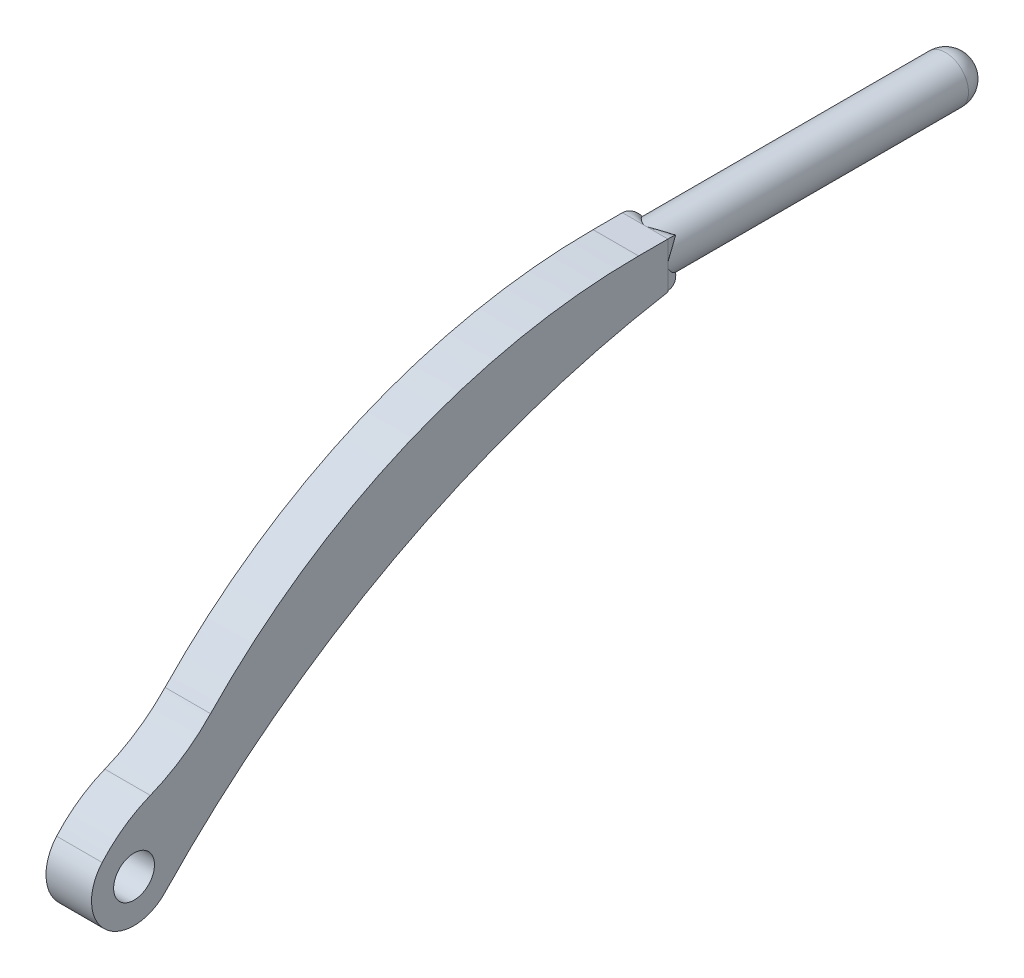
ISO-10303-21;
HEADER;
FILE_DESCRIPTION(('STEP AP214'),'2;1');
FILE_NAME('part.step','',(''),(''),'','','');
FILE_SCHEMA(('AUTOMOTIVE_DESIGN { 1 0 10303 214 1 1 1 1 }'));
ENDSEC;
DATA;
#1=APPLICATION_CONTEXT('core data for automotive mechanical design processes');
#2=APPLICATION_PROTOCOL_DEFINITION('international standard','automotive_design',2000,#1);
#3=PRODUCT_CONTEXT('',#1,'mechanical');
#4=PRODUCT('Part','Part','',(#3));
#5=PRODUCT_RELATED_PRODUCT_CATEGORY('part','',(#4));
#6=PRODUCT_DEFINITION_FORMATION('','',#4);
#7=PRODUCT_DEFINITION_CONTEXT('part definition',#1,'design');
#8=PRODUCT_DEFINITION('design','',#6,#7);
#9=PRODUCT_DEFINITION_SHAPE('','',#8);
#10=(LENGTH_UNIT() NAMED_UNIT(*) SI_UNIT(.MILLI.,.METRE.));
#11=(NAMED_UNIT(*) PLANE_ANGLE_UNIT() SI_UNIT($,.RADIAN.));
#12=(NAMED_UNIT(*) SI_UNIT($,.STERADIAN.) SOLID_ANGLE_UNIT());
#13=UNCERTAINTY_MEASURE_WITH_UNIT(LENGTH_MEASURE(1.E-05),#10,'distance_accuracy_value','');
#14=(GEOMETRIC_REPRESENTATION_CONTEXT(3) GLOBAL_UNCERTAINTY_ASSIGNED_CONTEXT((#13)) GLOBAL_UNIT_ASSIGNED_CONTEXT((#10,
#11,#12)) REPRESENTATION_CONTEXT('',''));
#15=CARTESIAN_POINT('',(0.,0.,0.));
#16=DIRECTION('',(0.,0.,1.));
#17=DIRECTION('',(1.,0.,0.));
#18=AXIS2_PLACEMENT_3D('',#15,#16,#17);
#19=CARTESIAN_POINT('',(0.,15.658076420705,-27.9975293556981));
#20=DIRECTION('',(0.,0.,-1.));
#21=DIRECTION('',(-1.,0.,0.));
#22=AXIS2_PLACEMENT_3D('',#19,#20,#21);
#23=CYLINDRICAL_SURFACE('',#22,1.3716);
#24=CARTESIAN_POINT('',(0.,15.658076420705,-49.8094));
#25=DIRECTION('',(0.,0.,1.));
#26=DIRECTION('',(1.,0.,0.));
#27=AXIS2_PLACEMENT_3D('',#24,#25,#26);
#28=CIRCLE('',#27,1.3716);
#29=CARTESIAN_POINT('',(1.3716,15.658076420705,-49.8094));
#30=VERTEX_POINT('',#29);
#31=EDGE_CURVE('E252',#30,#30,#28,.T.);
#32=ORIENTED_EDGE('',*,*,#31,.T.);
#33=EDGE_LOOP('',(#32));
#34=FACE_BOUND('',#33,.T.);
#35=CARTESIAN_POINT('',(-1.12012259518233,14.8664881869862,-32.8386269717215));
#36=CARTESIAN_POINT('',(-1.10384434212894,14.8434571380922,-32.8098896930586));
#37=CARTESIAN_POINT('',(-1.08693265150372,14.8210302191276,-32.7810355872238));
#38=CARTESIAN_POINT('',(-1.05188217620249,14.7773865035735,-32.7231599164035));
#39=CARTESIAN_POINT('',(-1.03374344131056,14.7561696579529,-32.6941383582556));
#40=CARTESIAN_POINT('',(-0.977538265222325,14.6943276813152,-32.6069089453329));
#41=CARTESIAN_POINT('',(-0.937688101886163,14.655518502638,-32.5485456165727));
#42=CARTESIAN_POINT('',(-0.853977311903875,14.583356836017,-32.4325555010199));
#43=CARTESIAN_POINT('',(-0.810166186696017,14.5499484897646,-32.3749277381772));
#44=CARTESIAN_POINT('',(-0.741596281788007,14.5039187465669,-32.2886403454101));
#45=CARTESIAN_POINT('',(-0.718270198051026,14.4892590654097,-32.2599106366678));
#46=CARTESIAN_POINT('',(-0.670839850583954,14.4614087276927,-32.2023838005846));
#47=CARTESIAN_POINT('',(-0.646735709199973,14.4482178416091,-32.1735866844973));
#48=CARTESIAN_POINT('',(-0.609870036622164,14.4294402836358,-32.1294331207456));
#49=CARTESIAN_POINT('',(-0.597209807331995,14.4232394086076,-32.114250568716));
#50=CARTESIAN_POINT('',(-0.571969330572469,14.4113481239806,-32.0835917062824));
#51=CARTESIAN_POINT('',(-0.559389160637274,14.4056581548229,-32.0681151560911));
#52=CARTESIAN_POINT('',(-0.53646080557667,14.3956859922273,-32.0388807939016));
#53=CARTESIAN_POINT('',(-0.526053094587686,14.3913192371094,-32.0251984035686));
#54=CARTESIAN_POINT('',(-0.506024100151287,14.3831878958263,-31.9970703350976));
#55=CARTESIAN_POINT('',(-0.49640223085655,14.3794228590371,-31.9826252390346));
#56=CARTESIAN_POINT('',(-0.483193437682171,14.3743959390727,-31.959421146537));
#57=CARTESIAN_POINT('',(-0.478887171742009,14.3727863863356,-31.9511585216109));
#58=CARTESIAN_POINT('',(-0.471236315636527,14.369961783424,-31.9341285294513));
#59=CARTESIAN_POINT('',(-0.467890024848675,14.3687460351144,-31.9253620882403));
#60=CARTESIAN_POINT('',(-0.463253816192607,14.3670739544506,-31.9092502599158));
#61=CARTESIAN_POINT('',(-0.461677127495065,14.3665108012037,-31.9020020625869));
#62=CARTESIAN_POINT('',(-0.459721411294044,14.3658132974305,-31.8873372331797));
#63=CARTESIAN_POINT('',(-0.459338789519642,14.3656776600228,-31.8799211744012));
#64=CARTESIAN_POINT('',(-0.459841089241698,14.3658563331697,-31.8651469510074));
#65=CARTESIAN_POINT('',(-0.460724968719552,14.366170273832,-31.8577887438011));
#66=CARTESIAN_POINT('',(-0.463592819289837,14.3671966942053,-31.8432837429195));
#67=CARTESIAN_POINT('',(-0.465583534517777,14.3679116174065,-31.8361385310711));
#68=CARTESIAN_POINT('',(-0.470378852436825,14.3696523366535,-31.822176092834));
#69=CARTESIAN_POINT('',(-0.473183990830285,14.3706783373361,-31.8153590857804));
#70=CARTESIAN_POINT('',(-0.479328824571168,14.3729532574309,-31.8021184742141));
#71=CARTESIAN_POINT('',(-0.482660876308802,14.3741990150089,-31.7956908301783));
#72=CARTESIAN_POINT('',(-0.486159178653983,14.3755259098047,-31.7893975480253));
#73=B_SPLINE_CURVE_WITH_KNOTS('',3,(#35,#36,#37,#38,#39,#40,#41,#42,#43,#44,#45,#46,#47,#48,#49,
#50,#51,#52,#53,#54,#55,#56,#57,#58,#59,#60,#61,#62,#63,#64,#65,#66,#67,#68,#69,#70,#71,#72),
.UNSPECIFIED.,.F.,.F.,(4,2,2,2,2,2,2,2,2,2,2,2,2,2,2,2,2,2,4),(0.,0.120772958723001,
0.241541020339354,0.483115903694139,0.722005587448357,0.841391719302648,0.960759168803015,
1.02290967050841,1.08511324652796,1.13831430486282,1.19147533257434,1.21980019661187,
1.24807456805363,1.27030031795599,1.29245910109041,1.3145996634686,1.33687663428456,
1.35916829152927,1.38116208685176),.UNSPECIFIED.);
#74=CARTESIAN_POINT('',(-1.01927650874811,14.740273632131,-32.6717009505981));
#75=VERTEX_POINT('',#74);
#76=CARTESIAN_POINT('',(-0.459513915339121,14.3657399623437,-31.877));
#77=VERTEX_POINT('',#76);
#78=EDGE_CURVE('E48',#75,#77,#73,.T.);
#79=ORIENTED_EDGE('',*,*,#78,.F.);
#80=CARTESIAN_POINT('',(-1.34017268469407,15.3661453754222,-31.7893975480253));
#81=CARTESIAN_POINT('',(-1.34136294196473,15.3716093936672,-31.7934983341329));
#82=CARTESIAN_POINT('',(-1.34252400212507,15.3771003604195,-31.7975708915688));
#83=CARTESIAN_POINT('',(-1.34478797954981,15.3881436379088,-31.8056799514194));
#84=CARTESIAN_POINT('',(-1.345890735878,15.3936960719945,-31.8097163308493));
#85=CARTESIAN_POINT('',(-1.34812954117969,15.4053482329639,-31.8181177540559));
#86=CARTESIAN_POINT('',(-1.34925948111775,15.4114517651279,-31.8224792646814));
#87=CARTESIAN_POINT('',(-1.35143266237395,15.4236520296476,-31.8311889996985));
#88=CARTESIAN_POINT('',(-1.35247614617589,15.4297487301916,-31.8355372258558));
#89=CARTESIAN_POINT('',(-1.35447564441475,15.441928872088,-31.8443449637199));
#90=CARTESIAN_POINT('',(-1.35543131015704,15.4480121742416,-31.8488048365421));
#91=CARTESIAN_POINT('',(-1.35673946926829,15.4566985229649,-31.8558241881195));
#92=CARTESIAN_POINT('',(-1.35714821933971,15.4594738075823,-31.858173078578));
#93=CARTESIAN_POINT('',(-1.35790854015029,15.4647440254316,-31.8631704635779));
#94=CARTESIAN_POINT('',(-1.35826089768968,15.4672426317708,-31.8658137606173));
#95=CARTESIAN_POINT('',(-1.35856182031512,15.4694062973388,-31.8692331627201));
#96=CARTESIAN_POINT('',(-1.35859391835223,15.4696376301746,-31.8696191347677));
#97=CARTESIAN_POINT('',(-1.35865452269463,15.4700751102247,-31.8704054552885));
#98=CARTESIAN_POINT('',(-1.35868302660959,15.470281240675,-31.870805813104));
#99=CARTESIAN_POINT('',(-1.35876190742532,15.470852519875,-31.8720249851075));
#100=CARTESIAN_POINT('',(-1.35880607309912,15.4711735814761,-31.8728664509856));
#101=CARTESIAN_POINT('',(-1.35886319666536,15.4715894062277,-31.8743924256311));
#102=CARTESIAN_POINT('',(-1.35888106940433,15.47171976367,-31.8750668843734));
#103=CARTESIAN_POINT('',(-1.35890078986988,15.4718636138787,-31.876429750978));
#104=CARTESIAN_POINT('',(-1.35890262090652,15.4718769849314,-31.8771181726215));
#105=CARTESIAN_POINT('',(-1.35888993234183,15.471784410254,-31.8784853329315));
#106=CARTESIAN_POINT('',(-1.35887543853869,15.471678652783,-31.8791640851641));
#107=CARTESIAN_POINT('',(-1.35883215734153,15.4713633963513,-31.8804957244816));
#108=CARTESIAN_POINT('',(-1.35880336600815,15.4711538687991,-31.8811486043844));
#109=CARTESIAN_POINT('',(-1.35871142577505,15.4704864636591,-31.8828486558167));
#110=CARTESIAN_POINT('',(-1.3586381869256,15.4699562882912,-31.8838663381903));
#111=CARTESIAN_POINT('',(-1.35847163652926,15.4687572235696,-31.8858161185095));
#112=CARTESIAN_POINT('',(-1.35837822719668,15.468087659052,-31.8867477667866));
#113=CARTESIAN_POINT('',(-1.35792031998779,15.4648269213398,-31.8909037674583));
#114=CARTESIAN_POINT('',(-1.35748578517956,15.4617901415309,-31.8937514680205));
#115=CARTESIAN_POINT('',(-1.3565630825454,15.4555080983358,-31.8991887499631));
#116=CARTESIAN_POINT('',(-1.35607453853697,15.4522614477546,-31.9017762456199));
#117=CARTESIAN_POINT('',(-1.35456902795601,15.4425038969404,-31.9092929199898));
#118=CARTESIAN_POINT('',(-1.35349808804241,15.4358736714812,-31.9140658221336));
#119=CARTESIAN_POINT('',(-1.35125244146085,15.4225993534,-31.9235667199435));
#120=CARTESIAN_POINT('',(-1.35007764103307,15.4159552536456,-31.9282946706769));
#121=CARTESIAN_POINT('',(-1.3464266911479,15.3961596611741,-31.9424726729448));
#122=CARTESIAN_POINT('',(-1.34381181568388,15.3830659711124,-31.9519719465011));
#123=CARTESIAN_POINT('',(-1.33543584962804,15.3440536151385,-31.9810715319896));
#124=CARTESIAN_POINT('',(-1.32917315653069,15.3185936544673,-32.0011469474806));
#125=CARTESIAN_POINT('',(-1.31549020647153,15.2689290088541,-32.0424340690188));
#126=CARTESIAN_POINT('',(-1.30806942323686,15.2447249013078,-32.0636462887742));
#127=CARTESIAN_POINT('',(-1.28414556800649,15.173535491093,-32.1289242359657));
#128=CARTESIAN_POINT('',(-1.26606135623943,15.1283290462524,-32.1743589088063));
#129=CARTESIAN_POINT('',(-1.22534907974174,15.0397705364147,-32.2699313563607));
#130=CARTESIAN_POINT('',(-1.20253216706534,14.9966407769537,-32.3201908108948));
#131=CARTESIAN_POINT('',(-1.15346925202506,14.9143773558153,-32.4223638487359));
#132=CARTESIAN_POINT('',(-1.12721960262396,14.8752480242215,-32.4742791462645));
#133=CARTESIAN_POINT('',(-1.07218512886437,14.8014641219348,-32.5780510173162));
#134=CARTESIAN_POINT('',(-1.04346167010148,14.7667355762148,-32.6298879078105));
#135=CARTESIAN_POINT('',(-0.983283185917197,14.7007821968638,-32.7339994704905));
#136=CARTESIAN_POINT('',(-0.951834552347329,14.6695495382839,-32.7862728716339));
#137=CARTESIAN_POINT('',(-0.919076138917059,14.6399479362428,-32.8386269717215));
#138=B_SPLINE_CURVE_WITH_KNOTS('',3,(#80,#81,#82,#83,#84,#85,#86,#87,#88,#89,#90,#91,#92,#93,
#94,#95,#96,#97,#98,#99,#100,#101,#102,#103,#104,#105,#106,#107,#108,#109,#110,#111,#112,#113,
#114,#115,#116,#117,#118,#119,#120,#121,#122,#123,#124,#125,#126,#127,#128,#129,#130,#131,#132,
#133,#134,#135,#136,#137),.UNSPECIFIED.,.F.,.F.,(4,2,2,2,2,2,2,2,2,2,2,2,2,2,2,2,2,2,2,2,2,2,2,
2,2,2,2,2,4),(0.,0.020802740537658,0.0416601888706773,0.0644165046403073,0.087106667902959,
0.109883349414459,0.120875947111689,0.131698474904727,0.133050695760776,0.134403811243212,
0.137093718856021,0.13914629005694,0.141200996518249,0.143252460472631,0.145304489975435,
0.148733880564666,0.152180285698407,0.164640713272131,0.177194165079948,0.201892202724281,
0.226612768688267,0.275762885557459,0.374752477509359,0.473787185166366,0.673214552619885,
0.88312243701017,1.09325517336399,1.29917574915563,1.5046257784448),.UNSPECIFIED.);
#139=CARTESIAN_POINT('',(-1.3589,15.4718578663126,-31.877));
#140=VERTEX_POINT('',#139);
#141=EDGE_CURVE('E160',#140,#75,#138,.T.);
#142=ORIENTED_EDGE('',*,*,#141,.F.);
#143=CARTESIAN_POINT('',(0.,15.658076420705,-31.877));
#144=DIRECTION('',(0.,0.,1.));
#145=DIRECTION('',(1.,0.,0.));
#146=AXIS2_PLACEMENT_3D('',#143,#144,#145);
#147=CIRCLE('',#146,1.3716);
#148=CARTESIAN_POINT('',(-1.3589,15.8442949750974,-31.877));
#149=VERTEX_POINT('',#148);
#150=EDGE_CURVE('E155',#149,#140,#147,.T.);
#151=ORIENTED_EDGE('',*,*,#150,.F.);
#152=CARTESIAN_POINT('',(-1.3589,15.8442949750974,-31.877));
#153=CARTESIAN_POINT('',(-1.35889585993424,15.8443251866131,-31.8770168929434));
#154=CARTESIAN_POINT('',(-1.35889170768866,15.8443554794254,-31.8770336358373));
#155=CARTESIAN_POINT('',(-1.35888556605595,15.8444002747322,-31.8770583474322));
#156=CARTESIAN_POINT('',(-1.35888357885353,15.8444147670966,-31.8770663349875));
#157=CARTESIAN_POINT('',(-1.35887364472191,15.8444872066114,-31.8771063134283));
#158=CARTESIAN_POINT('',(-1.35886570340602,15.8445450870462,-31.8771384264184));
#159=CARTESIAN_POINT('',(-1.35882597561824,15.8448345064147,-31.8772989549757));
#160=CARTESIAN_POINT('',(-1.35879412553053,15.845066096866,-31.8774272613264));
#161=CARTESIAN_POINT('',(-1.35863462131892,15.8462237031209,-31.8780693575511));
#162=CARTESIAN_POINT('',(-1.35850620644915,15.8471486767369,-31.8785848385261));
#163=CARTESIAN_POINT('',(-1.35785994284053,15.8517691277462,-31.8811693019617));
#164=CARTESIAN_POINT('',(-1.35732956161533,15.8554510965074,-31.8832593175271));
#165=CARTESIAN_POINT('',(-1.35461172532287,15.8737931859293,-31.8938217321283));
#166=CARTESIAN_POINT('',(-1.35222843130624,15.888235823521,-31.9026232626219));
#167=CARTESIAN_POINT('',(-1.34448386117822,15.9310093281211,-31.9299468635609));
#168=CARTESIAN_POINT('',(-1.33854016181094,15.9586832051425,-31.9493339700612));
#169=CARTESIAN_POINT('',(-1.32531024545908,16.012486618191,-31.9897426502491));
#170=CARTESIAN_POINT('',(-1.31802273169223,16.0386146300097,-32.0107657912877));
#171=CARTESIAN_POINT('',(-1.29697744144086,16.1065389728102,-32.0685143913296));
#172=CARTESIAN_POINT('',(-1.28215774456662,16.1470937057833,-32.1063163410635));
#173=CARTESIAN_POINT('',(-1.24971172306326,16.2248920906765,-32.1840814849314));
#174=CARTESIAN_POINT('',(-1.23208230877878,16.2621320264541,-32.2240470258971));
#175=CARTESIAN_POINT('',(-1.17527619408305,16.3698741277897,-32.346578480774));
#176=CARTESIAN_POINT('',(-1.13233934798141,16.4359264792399,-32.4313508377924));
#177=CARTESIAN_POINT('',(-1.04845165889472,16.5444356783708,-32.5845330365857));
#178=CARTESIAN_POINT('',(-1.00912184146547,16.5888930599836,-32.6524646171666));
#179=CARTESIAN_POINT('',(-0.925669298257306,16.6719267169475,-32.7890619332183));
#180=CARTESIAN_POINT('',(-0.881543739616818,16.7104994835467,-32.8577280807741));
#181=CARTESIAN_POINT('',(-0.78958220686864,16.7810810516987,-32.9936618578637));
#182=CARTESIAN_POINT('',(-0.74183494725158,16.8132027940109,-33.0609307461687));
#183=CARTESIAN_POINT('',(-0.666920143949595,16.8569669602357,-33.1612261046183));
#184=CARTESIAN_POINT('',(-0.641409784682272,16.8708142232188,-33.1945441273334));
#185=CARTESIAN_POINT('',(-0.589262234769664,16.8969896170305,-33.260900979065));
#186=CARTESIAN_POINT('',(-0.562624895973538,16.9093175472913,-33.2939397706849));
#187=CARTESIAN_POINT('',(-0.535415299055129,16.9208578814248,-33.3267919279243));
#188=B_SPLINE_CURVE_WITH_KNOTS('',3,(#152,#153,#154,#155,#156,#157,#158,#159,#160,#161,#162,
#163,#164,#165,#166,#167,#168,#169,#170,#171,#172,#173,#174,#175,#176,#177,#178,#179,#180,#181,
#182,#183,#184,#185,#186,#187),.UNSPECIFIED.,.F.,.F.,(4,2,2,2,2,2,2,2,2,2,2,2,2,2,2,2,2,4),(0.,
0.000104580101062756,0.000154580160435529,0.000354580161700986,0.00115458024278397,
0.00435458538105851,0.0171549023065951,0.0683725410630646,0.171155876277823,0.274038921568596,
0.445909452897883,0.617970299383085,0.964042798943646,1.23439404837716,1.50490587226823,
1.77016351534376,1.90269254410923,2.03523904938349),.UNSPECIFIED.);
#189=CARTESIAN_POINT('',(-0.983239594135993,16.6143851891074,-32.6946557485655));
#190=VERTEX_POINT('',#189);
#191=EDGE_CURVE('E213',#190,#149,#188,.F.);
#192=ORIENTED_EDGE('',*,*,#191,.F.);
#193=CARTESIAN_POINT('',(-0.0527930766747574,17.0286600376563,-31.877));
#194=CARTESIAN_POINT('',(-0.0528976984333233,17.0286560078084,-31.8770283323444));
#195=CARTESIAN_POINT('',(-0.0530025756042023,17.0286519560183,-31.8770556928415));
#196=CARTESIAN_POINT('',(-0.0531284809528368,17.0286470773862,-31.8770887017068));
#197=CARTESIAN_POINT('',(-0.0531495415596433,17.0286462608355,-31.8770942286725));
#198=CARTESIAN_POINT('',(-0.0532548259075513,17.0286421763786,-31.8771219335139));
#199=CARTESIAN_POINT('',(-0.0533389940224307,17.0286389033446,-31.8771443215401));
#200=CARTESIAN_POINT('',(-0.0537598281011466,17.0286224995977,-31.8772562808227));
#201=CARTESIAN_POINT('',(-0.0540964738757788,17.0286092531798,-31.8773459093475));
#202=CARTESIAN_POINT('',(-0.0557791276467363,17.0285424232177,-31.8777961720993));
#203=CARTESIAN_POINT('',(-0.0571233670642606,17.0284870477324,-31.8781631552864));
#204=CARTESIAN_POINT('',(-0.0638367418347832,17.0282006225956,-31.8800280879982));
#205=CARTESIAN_POINT('',(-0.0691799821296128,17.0279410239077,-31.8816154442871));
#206=CARTESIAN_POINT('',(-0.0957924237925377,17.0264934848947,-31.8899732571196));
#207=CARTESIAN_POINT('',(-0.116649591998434,17.0248608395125,-31.8979796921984));
#208=CARTESIAN_POINT('',(-0.178336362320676,17.0186662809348,-31.9246234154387));
#209=CARTESIAN_POINT('',(-0.217908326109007,17.0128138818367,-31.9457920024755));
#210=CARTESIAN_POINT('',(-0.294372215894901,16.9982814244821,-31.9918228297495));
#211=CARTESIAN_POINT('',(-0.331252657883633,16.9895900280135,-32.0166996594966));
#212=CARTESIAN_POINT('',(-0.410718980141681,16.9675277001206,-32.0747392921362));
#213=CARTESIAN_POINT('',(-0.452695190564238,16.9535420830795,-32.1084999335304));
#214=CARTESIAN_POINT('',(-0.533518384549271,16.9224015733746,-32.1782545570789));
#215=CARTESIAN_POINT('',(-0.572361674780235,16.9052430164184,-32.2142510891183));
#216=CARTESIAN_POINT('',(-0.684917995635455,16.8493899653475,-32.3246557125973));
#217=CARTESIAN_POINT('',(-0.754391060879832,16.8063978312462,-32.4012696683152));
#218=CARTESIAN_POINT('',(-0.862632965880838,16.72584324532,-32.5318720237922));
#219=CARTESIAN_POINT('',(-0.904137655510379,16.6909060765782,-32.5853026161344));
#220=CARTESIAN_POINT('',(-0.98255298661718,16.6166143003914,-32.6925296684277));
#221=CARTESIAN_POINT('',(-1.01946203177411,16.5772581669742,-32.7463262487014));
#222=CARTESIAN_POINT('',(-1.08810928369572,16.4948245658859,-32.8528401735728));
#223=CARTESIAN_POINT('',(-1.11991345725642,16.45180785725,-32.9055619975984));
#224=CARTESIAN_POINT('',(-1.17868184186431,16.3615443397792,-33.0100290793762));
#225=CARTESIAN_POINT('',(-1.20564772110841,16.3142989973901,-33.0617746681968));
#226=CARTESIAN_POINT('',(-1.23005968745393,16.2649040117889,-33.112716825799));
#227=B_SPLINE_CURVE_WITH_KNOTS('',3,(#193,#194,#195,#196,#197,#198,#199,#200,#201,#202,#203,
#204,#205,#206,#207,#208,#209,#210,#211,#212,#213,#214,#215,#216,#217,#218,#219,#220,#221,#222,
#223,#224,#225,#226),.UNSPECIFIED.,.F.,.F.,(4,2,2,2,2,2,2,2,2,2,2,2,2,2,2,2,4),(0.,
0.000325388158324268,0.000390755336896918,0.000652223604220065,0.00169809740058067,
0.00588163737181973,0.0226183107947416,0.0896693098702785,0.224903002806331,0.360683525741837,
0.527340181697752,0.694190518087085,1.02892357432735,1.25714455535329,1.48544459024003,
1.71050369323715,1.93548504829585),.UNSPECIFIED.);
#228=CARTESIAN_POINT('',(-0.0527930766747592,17.0286600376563,-31.877));
#229=VERTEX_POINT('',#228);
#230=EDGE_CURVE('E219',#229,#190,#227,.T.);
#231=ORIENTED_EDGE('',*,*,#230,.F.);
#232=CARTESIAN_POINT('',(0.0527930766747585,17.0286600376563,-31.877));
#233=DIRECTION('',(-1.,0.,0.));
#234=VECTOR('',#233,1.);
#235=LINE('',#232,#234);
#236=CARTESIAN_POINT('',(0.0527930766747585,17.0286600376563,-31.877));
#237=VERTEX_POINT('',#236);
#238=EDGE_CURVE('E339',#237,#229,#235,.T.);
#239=ORIENTED_EDGE('',*,*,#238,.F.);
#240=CARTESIAN_POINT('',(0.0527930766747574,17.0286600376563,-31.877));
#241=CARTESIAN_POINT('',(0.0528976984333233,17.0286560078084,-31.8770283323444));
#242=CARTESIAN_POINT('',(0.0530025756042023,17.0286519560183,-31.8770556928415));
#243=CARTESIAN_POINT('',(0.0531284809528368,17.0286470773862,-31.8770887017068));
#244=CARTESIAN_POINT('',(0.0531495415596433,17.0286462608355,-31.8770942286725));
#245=CARTESIAN_POINT('',(0.0532548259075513,17.0286421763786,-31.8771219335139));
#246=CARTESIAN_POINT('',(0.0533389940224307,17.0286389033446,-31.8771443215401));
#247=CARTESIAN_POINT('',(0.0537598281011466,17.0286224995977,-31.8772562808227));
#248=CARTESIAN_POINT('',(0.0540964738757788,17.0286092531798,-31.8773459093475));
#249=CARTESIAN_POINT('',(0.0557791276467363,17.0285424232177,-31.8777961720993));
#250=CARTESIAN_POINT('',(0.0571233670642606,17.0284870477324,-31.8781631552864));
#251=CARTESIAN_POINT('',(0.0638367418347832,17.0282006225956,-31.8800280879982));
#252=CARTESIAN_POINT('',(0.0691799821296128,17.0279410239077,-31.8816154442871));
#253=CARTESIAN_POINT('',(0.0957924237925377,17.0264934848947,-31.8899732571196));
#254=CARTESIAN_POINT('',(0.116649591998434,17.0248608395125,-31.8979796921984));
#255=CARTESIAN_POINT('',(0.178336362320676,17.0186662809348,-31.9246234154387));
#256=CARTESIAN_POINT('',(0.217908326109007,17.0128138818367,-31.9457920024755));
#257=CARTESIAN_POINT('',(0.294372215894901,16.9982814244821,-31.9918228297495));
#258=CARTESIAN_POINT('',(0.331252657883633,16.9895900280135,-32.0166996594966));
#259=CARTESIAN_POINT('',(0.410718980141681,16.9675277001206,-32.0747392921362));
#260=CARTESIAN_POINT('',(0.452695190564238,16.9535420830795,-32.1084999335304));
#261=CARTESIAN_POINT('',(0.533518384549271,16.9224015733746,-32.1782545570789));
#262=CARTESIAN_POINT('',(0.572361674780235,16.9052430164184,-32.2142510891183));
#263=CARTESIAN_POINT('',(0.684917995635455,16.8493899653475,-32.3246557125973));
#264=CARTESIAN_POINT('',(0.754391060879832,16.8063978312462,-32.4012696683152));
#265=CARTESIAN_POINT('',(0.862632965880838,16.72584324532,-32.5318720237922));
#266=CARTESIAN_POINT('',(0.904137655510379,16.6909060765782,-32.5853026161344));
#267=CARTESIAN_POINT('',(0.98255298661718,16.6166143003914,-32.6925296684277));
#268=CARTESIAN_POINT('',(1.01946203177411,16.5772581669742,-32.7463262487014));
#269=CARTESIAN_POINT('',(1.08810928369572,16.4948245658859,-32.8528401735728));
#270=CARTESIAN_POINT('',(1.11991345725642,16.45180785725,-32.9055619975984));
#271=CARTESIAN_POINT('',(1.17868184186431,16.3615443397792,-33.0100290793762));
#272=CARTESIAN_POINT('',(1.20564772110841,16.3142989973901,-33.0617746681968));
#273=CARTESIAN_POINT('',(1.23005968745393,16.2649040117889,-33.112716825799));
#274=B_SPLINE_CURVE_WITH_KNOTS('',3,(#240,#241,#242,#243,#244,#245,#246,#247,#248,#249,#250,
#251,#252,#253,#254,#255,#256,#257,#258,#259,#260,#261,#262,#263,#264,#265,#266,#267,#268,#269,
#270,#271,#272,#273),.UNSPECIFIED.,.F.,.F.,(4,2,2,2,2,2,2,2,2,2,2,2,2,2,2,2,4),(0.,
0.000325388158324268,0.000390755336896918,0.000652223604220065,0.00169809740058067,
0.00588163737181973,0.0226183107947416,0.0896693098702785,0.224903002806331,0.360683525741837,
0.527340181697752,0.694190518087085,1.02892357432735,1.25714455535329,1.48544459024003,
1.71050369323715,1.93548504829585),.UNSPECIFIED.);
#275=CARTESIAN_POINT('',(0.983239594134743,16.614385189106,-32.6946557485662));
#276=VERTEX_POINT('',#275);
#277=EDGE_CURVE('E41',#276,#237,#274,.F.);
#278=ORIENTED_EDGE('',*,*,#277,.F.);
#279=CARTESIAN_POINT('',(1.3589,15.8442949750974,-31.877));
#280=CARTESIAN_POINT('',(1.35889585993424,15.8443251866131,-31.8770168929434));
#281=CARTESIAN_POINT('',(1.35889170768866,15.8443554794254,-31.8770336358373));
#282=CARTESIAN_POINT('',(1.35888556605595,15.8444002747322,-31.8770583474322));
#283=CARTESIAN_POINT('',(1.35888357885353,15.8444147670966,-31.8770663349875));
#284=CARTESIAN_POINT('',(1.35887364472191,15.8444872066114,-31.8771063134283));
#285=CARTESIAN_POINT('',(1.35886570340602,15.8445450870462,-31.8771384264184));
#286=CARTESIAN_POINT('',(1.35882597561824,15.8448345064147,-31.8772989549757));
#287=CARTESIAN_POINT('',(1.35879412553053,15.845066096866,-31.8774272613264));
#288=CARTESIAN_POINT('',(1.35863462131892,15.8462237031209,-31.8780693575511));
#289=CARTESIAN_POINT('',(1.35850620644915,15.8471486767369,-31.8785848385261));
#290=CARTESIAN_POINT('',(1.35785994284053,15.8517691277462,-31.8811693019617));
#291=CARTESIAN_POINT('',(1.35732956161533,15.8554510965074,-31.8832593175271));
#292=CARTESIAN_POINT('',(1.35461172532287,15.8737931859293,-31.8938217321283));
#293=CARTESIAN_POINT('',(1.35222843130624,15.888235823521,-31.9026232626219));
#294=CARTESIAN_POINT('',(1.34448386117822,15.9310093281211,-31.9299468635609));
#295=CARTESIAN_POINT('',(1.33854016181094,15.9586832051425,-31.9493339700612));
#296=CARTESIAN_POINT('',(1.32531024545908,16.012486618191,-31.9897426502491));
#297=CARTESIAN_POINT('',(1.31802273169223,16.0386146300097,-32.0107657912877));
#298=CARTESIAN_POINT('',(1.29697744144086,16.1065389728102,-32.0685143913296));
#299=CARTESIAN_POINT('',(1.28215774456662,16.1470937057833,-32.1063163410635));
#300=CARTESIAN_POINT('',(1.24971172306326,16.2248920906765,-32.1840814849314));
#301=CARTESIAN_POINT('',(1.23208230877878,16.2621320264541,-32.2240470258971));
#302=CARTESIAN_POINT('',(1.17527619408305,16.3698741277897,-32.346578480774));
#303=CARTESIAN_POINT('',(1.13233934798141,16.4359264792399,-32.4313508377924));
#304=CARTESIAN_POINT('',(1.04845165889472,16.5444356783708,-32.5845330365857));
#305=CARTESIAN_POINT('',(1.00912184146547,16.5888930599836,-32.6524646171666));
#306=CARTESIAN_POINT('',(0.925669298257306,16.6719267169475,-32.7890619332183));
#307=CARTESIAN_POINT('',(0.881543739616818,16.7104994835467,-32.8577280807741));
#308=CARTESIAN_POINT('',(0.78958220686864,16.7810810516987,-32.9936618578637));
#309=CARTESIAN_POINT('',(0.74183494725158,16.8132027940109,-33.0609307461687));
#310=CARTESIAN_POINT('',(0.666920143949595,16.8569669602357,-33.1612261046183));
#311=CARTESIAN_POINT('',(0.641409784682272,16.8708142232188,-33.1945441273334));
#312=CARTESIAN_POINT('',(0.589262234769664,16.8969896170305,-33.260900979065));
#313=CARTESIAN_POINT('',(0.562624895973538,16.9093175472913,-33.2939397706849));
#314=CARTESIAN_POINT('',(0.535415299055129,16.9208578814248,-33.3267919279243));
#315=B_SPLINE_CURVE_WITH_KNOTS('',3,(#279,#280,#281,#282,#283,#284,#285,#286,#287,#288,#289,
#290,#291,#292,#293,#294,#295,#296,#297,#298,#299,#300,#301,#302,#303,#304,#305,#306,#307,#308,
#309,#310,#311,#312,#313,#314),.UNSPECIFIED.,.F.,.F.,(4,2,2,2,2,2,2,2,2,2,2,2,2,2,2,2,2,4),(0.,
0.000104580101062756,0.000154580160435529,0.000354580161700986,0.00115458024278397,
0.00435458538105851,0.0171549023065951,0.0683725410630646,0.171155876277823,0.274038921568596,
0.445909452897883,0.617970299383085,0.964042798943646,1.23439404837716,1.50490587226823,
1.77016351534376,1.90269254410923,2.03523904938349),.UNSPECIFIED.);
#316=CARTESIAN_POINT('',(1.3589,15.8442949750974,-31.877));
#317=VERTEX_POINT('',#316);
#318=EDGE_CURVE('E357',#317,#276,#315,.T.);
#319=ORIENTED_EDGE('',*,*,#318,.F.);
#320=CARTESIAN_POINT('',(1.3589,15.4718578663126,-31.877));
#321=VERTEX_POINT('',#320);
#322=EDGE_CURVE('E159',#321,#317,#147,.T.);
#323=ORIENTED_EDGE('',*,*,#322,.F.);
#324=CARTESIAN_POINT('',(0.919076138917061,14.6399479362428,-32.8386269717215));
#325=CARTESIAN_POINT('',(0.940274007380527,14.6590873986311,-32.804752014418));
#326=CARTESIAN_POINT('',(0.960913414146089,14.6789161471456,-32.7709245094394));
#327=CARTESIAN_POINT('',(1.0010527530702,14.7199899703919,-32.7034376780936));
#328=CARTESIAN_POINT('',(1.02055235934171,14.7412354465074,-32.669778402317));
#329=CARTESIAN_POINT('',(1.07742634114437,14.8072950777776,-32.5689500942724));
#330=CARTESIAN_POINT('',(1.11302257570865,14.854294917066,-32.5021760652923));
#331=CARTESIAN_POINT('',(1.17681942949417,14.9513001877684,-32.3750207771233));
#332=CARTESIAN_POINT('',(1.20534983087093,15.0009134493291,-32.3145056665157));
#333=CARTESIAN_POINT('',(1.25710585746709,15.1063315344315,-32.1966691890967));
#334=CARTESIAN_POINT('',(1.28033861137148,15.1621278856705,-32.1393436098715));
#335=CARTESIAN_POINT('',(1.30647568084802,15.2400073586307,-32.067984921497));
#336=CARTESIAN_POINT('',(1.3123418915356,15.2587746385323,-32.0513837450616));
#337=CARTESIAN_POINT('',(1.3206214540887,15.2874759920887,-32.0269858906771));
#338=CARTESIAN_POINT('',(1.32329273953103,15.2971268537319,-32.0189435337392));
#339=CARTESIAN_POINT('',(1.32845632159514,15.3166207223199,-32.0030325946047));
#340=CARTESIAN_POINT('',(1.3309485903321,15.3264637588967,-31.9951640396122));
#341=CARTESIAN_POINT('',(1.33574501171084,15.3463451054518,-31.9796094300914));
#342=CARTESIAN_POINT('',(1.33804908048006,15.3563835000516,-31.9719234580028));
#343=CARTESIAN_POINT('',(1.34245529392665,15.3766376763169,-31.9567335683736));
#344=CARTESIAN_POINT('',(1.34455748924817,15.3868534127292,-31.9492296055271));
#345=CARTESIAN_POINT('',(1.34854494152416,15.4074320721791,-31.934371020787));
#346=CARTESIAN_POINT('',(1.35043017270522,15.4177950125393,-31.9270164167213));
#347=CARTESIAN_POINT('',(1.35306944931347,15.4333162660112,-31.9158923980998));
#348=CARTESIAN_POINT('',(1.35391775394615,15.4384859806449,-31.9121691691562));
#349=CARTESIAN_POINT('',(1.35553727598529,15.4487150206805,-31.9045651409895));
#350=CARTESIAN_POINT('',(1.35630837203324,15.4537741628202,-31.9006841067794));
#351=CARTESIAN_POINT('',(1.3575163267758,15.4619979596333,-31.8935756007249));
#352=CARTESIAN_POINT('',(1.35798316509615,15.4652677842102,-31.8905127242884));
#353=CARTESIAN_POINT('',(1.35842803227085,15.4684447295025,-31.8862410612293));
#354=CARTESIAN_POINT('',(1.35849777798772,15.4689453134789,-31.8855157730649));
#355=CARTESIAN_POINT('',(1.35862523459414,15.4698631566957,-31.8840114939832));
#356=CARTESIAN_POINT('',(1.35868293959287,15.470280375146,-31.8832324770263));
#357=CARTESIAN_POINT('',(1.3587741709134,15.4709416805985,-31.8817346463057));
#358=CARTESIAN_POINT('',(1.35880998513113,15.4712020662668,-31.8810233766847));
#359=CARTESIAN_POINT('',(1.358864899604,15.4716017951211,-31.8795675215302));
#360=CARTESIAN_POINT('',(1.35888404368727,15.4717414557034,-31.8788230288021));
#361=CARTESIAN_POINT('',(1.3589027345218,15.4718778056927,-31.8773139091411));
#362=CARTESIAN_POINT('',(1.35890211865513,15.4718733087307,-31.8765491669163));
#363=CARTESIAN_POINT('',(1.35888098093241,15.4717191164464,-31.8750346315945));
#364=CARTESIAN_POINT('',(1.35886043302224,15.47156923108,-31.8742848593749));
#365=CARTESIAN_POINT('',(1.3587954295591,15.471096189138,-31.8726352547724));
#366=CARTESIAN_POINT('',(1.3587462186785,15.4707386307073,-31.8717458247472));
#367=CARTESIAN_POINT('',(1.35862947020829,15.4698937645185,-31.870032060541));
#368=CARTESIAN_POINT('',(1.35856187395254,15.4694060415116,-31.8692079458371));
#369=CARTESIAN_POINT('',(1.35827277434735,15.4673305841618,-31.8660711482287));
#370=CARTESIAN_POINT('',(1.35800694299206,15.4654432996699,-31.8639698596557));
#371=CARTESIAN_POINT('',(1.35743508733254,15.4614527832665,-31.8599876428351));
#372=CARTESIAN_POINT('',(1.35712872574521,15.4593477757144,-31.8581088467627));
#373=CARTESIAN_POINT('',(1.35607057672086,15.452202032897,-31.8520445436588));
#374=CARTESIAN_POINT('',(1.35526609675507,15.4469644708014,-31.8480984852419));
#375=CARTESIAN_POINT('',(1.35358026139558,15.4364093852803,-31.8403316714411));
#376=CARTESIAN_POINT('',(1.35269877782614,15.4310917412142,-31.8365111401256));
#377=CARTESIAN_POINT('',(1.34996426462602,15.4151816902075,-31.825122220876));
#378=CARTESIAN_POINT('',(1.34801324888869,15.4045784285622,-31.8175874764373));
#379=CARTESIAN_POINT('',(1.34503208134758,15.3893791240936,-31.8065783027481));
#380=CARTESIAN_POINT('',(1.34409183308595,15.3847152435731,-31.8031713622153));
#381=CARTESIAN_POINT('',(1.34216573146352,15.3754101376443,-31.7963147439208));
#382=CARTESIAN_POINT('',(1.34117977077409,15.3707689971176,-31.7928649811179));
#383=CARTESIAN_POINT('',(1.34017268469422,15.3661453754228,-31.7893975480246));
#384=B_SPLINE_CURVE_WITH_KNOTS('',3,(#324,#325,#326,#327,#328,#329,#330,#331,#332,#333,#334,
#335,#336,#337,#338,#339,#340,#341,#342,#343,#344,#345,#346,#347,#348,#349,#350,#351,#352,#353,
#354,#355,#356,#357,#358,#359,#360,#361,#362,#363,#364,#365,#366,#367,#368,#369,#370,#371,#372,
#373,#374,#375,#376,#377,#378,#379,#380,#381,#382,#383),.UNSPECIFIED.,.F.,.F.,(4,2,2,2,2,2,2,2,
2,2,2,2,2,2,2,2,2,2,2,2,2,2,2,2,2,2,2,2,2,4),(0.,0.132901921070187,0.265841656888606,
0.532679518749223,0.782224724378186,1.03143212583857,1.10860972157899,1.14713649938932,
1.18566926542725,1.22421911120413,1.26275926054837,1.30130398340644,1.32057502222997,
1.33987589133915,1.35325747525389,1.35590517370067,1.35855416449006,1.36082073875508,
1.36308133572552,1.3653605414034,1.36764273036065,1.37050602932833,1.37337857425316,
1.38181978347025,1.3903362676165,1.41012873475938,1.4299547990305,1.46940616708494,
1.48696134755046,1.50456006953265),.UNSPECIFIED.);
#385=CARTESIAN_POINT('',(1.01927650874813,14.740273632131,-32.6717009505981));
#386=VERTEX_POINT('',#385);
#387=EDGE_CURVE('E206',#386,#321,#384,.T.);
#388=ORIENTED_EDGE('',*,*,#387,.F.);
#389=CARTESIAN_POINT('',(0.486159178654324,14.3755259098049,-31.7893975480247));
#390=CARTESIAN_POINT('',(0.481531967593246,14.3737696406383,-31.7977298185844));
#391=CARTESIAN_POINT('',(0.477169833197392,14.3721475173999,-31.8063394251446));
#392=CARTESIAN_POINT('',(0.469509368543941,14.3693316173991,-31.8242305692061));
#393=CARTESIAN_POINT('',(0.466228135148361,14.3681446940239,-31.8335203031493));
#394=CARTESIAN_POINT('',(0.462055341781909,14.3666449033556,-31.8501779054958));
#395=CARTESIAN_POINT('',(0.460766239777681,14.3661857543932,-31.8574256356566));
#396=CARTESIAN_POINT('',(0.4594101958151,14.3657028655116,-31.8720030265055));
#397=CARTESIAN_POINT('',(0.459334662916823,14.3656760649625,-31.8793317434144));
#398=CARTESIAN_POINT('',(0.460396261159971,14.3660539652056,-31.893884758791));
#399=CARTESIAN_POINT('',(0.461533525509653,14.3664587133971,-31.9011090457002));
#400=CARTESIAN_POINT('',(0.46482397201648,14.367639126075,-31.9153060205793));
#401=CARTESIAN_POINT('',(0.46698080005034,14.3684161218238,-31.9222777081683));
#402=CARTESIAN_POINT('',(0.475775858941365,14.3716216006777,-31.9460834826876));
#403=CARTESIAN_POINT('',(0.484294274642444,14.3747828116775,-31.9620858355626));
#404=CARTESIAN_POINT('',(0.50306033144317,14.3820190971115,-31.9928616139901));
#405=CARTESIAN_POINT('',(0.513324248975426,14.3861029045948,-32.0076213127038));
#406=CARTESIAN_POINT('',(0.535706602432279,14.3953542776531,-32.0380446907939));
#407=CARTESIAN_POINT('',(0.547904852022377,14.4005916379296,-32.0536292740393));
#408=CARTESIAN_POINT('',(0.572580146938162,14.4116323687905,-32.0843744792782));
#409=CARTESIAN_POINT('',(0.585057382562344,14.4174361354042,-32.0995347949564));
#410=CARTESIAN_POINT('',(0.622542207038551,14.4355805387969,-32.1447490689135));
#411=CARTESIAN_POINT('',(0.647572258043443,14.4486417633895,-32.1744982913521));
#412=CARTESIAN_POINT('',(0.696779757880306,14.4763055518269,-32.2337125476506));
#413=CARTESIAN_POINT('',(0.720960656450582,14.4909005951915,-32.2631782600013));
#414=CARTESIAN_POINT('',(0.768350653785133,14.5215382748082,-32.3221074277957));
#415=CARTESIAN_POINT('',(0.791560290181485,14.5375800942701,-32.35157087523));
#416=CARTESIAN_POINT('',(0.843477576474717,14.5758779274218,-32.4190960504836));
#417=CARTESIAN_POINT('',(0.8718294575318,14.5985876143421,-32.4571752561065));
#418=CARTESIAN_POINT('',(0.926634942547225,14.6461714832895,-32.5333644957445));
#419=CARTESIAN_POINT('',(0.953088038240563,14.6710462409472,-32.5714745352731));
#420=CARTESIAN_POINT('',(1.00422595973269,14.7231106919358,-32.6479233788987));
#421=CARTESIAN_POINT('',(1.02889378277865,14.7503183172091,-32.6862613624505));
#422=CARTESIAN_POINT('',(1.07611504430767,14.8068336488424,-32.7626768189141));
#423=CARTESIAN_POINT('',(1.09866885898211,14.8361409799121,-32.8007543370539));
#424=CARTESIAN_POINT('',(1.12012259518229,14.8664881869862,-32.8386269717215));
#425=B_SPLINE_CURVE_WITH_KNOTS('',3,(#389,#390,#391,#392,#393,#394,#395,#396,#397,#398,#399,
#400,#401,#402,#403,#404,#405,#406,#407,#408,#409,#410,#411,#412,#413,#414,#415,#416,#417,#418,
#419,#420,#421,#422,#423,#424),.UNSPECIFIED.,.F.,.F.,(4,2,2,2,2,2,2,2,2,2,2,2,2,2,2,2,2,4),(0.,
0.0292078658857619,0.0588577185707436,0.0808825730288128,0.102751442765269,0.124622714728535,
0.146572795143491,0.201326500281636,0.256621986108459,0.317998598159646,0.37941843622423,
0.502409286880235,0.62482299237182,0.747168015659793,0.904966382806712,1.06280683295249,
1.22199328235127,1.38115135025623),.UNSPECIFIED.);
#426=CARTESIAN_POINT('',(0.459513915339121,14.3657399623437,-31.877));
#427=VERTEX_POINT('',#426);
#428=EDGE_CURVE('E199',#427,#386,#425,.T.);
#429=ORIENTED_EDGE('',*,*,#428,.F.);
#430=CARTESIAN_POINT('',(0.0527930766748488,14.2874928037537,-31.877));
#431=VERTEX_POINT('',#430);
#432=EDGE_CURVE('E267',#431,#427,#147,.T.);
#433=ORIENTED_EDGE('',*,*,#432,.F.);
#434=CARTESIAN_POINT('',(0.,15.658076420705,-31.877));
#435=DIRECTION('',(0.,0.,-1.));
#436=DIRECTION('',(0.0384901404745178,-0.999258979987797,0.));
#437=AXIS2_PLACEMENT_3D('',#434,#435,#436);
#438=CIRCLE('',#437,1.3716);
#439=CARTESIAN_POINT('',(-0.0527930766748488,14.2874928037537,-31.877));
#440=VERTEX_POINT('',#439);
#441=EDGE_CURVE('E281',#431,#440,#438,.T.);
#442=ORIENTED_EDGE('',*,*,#441,.T.);
#443=EDGE_CURVE('E35',#77,#440,#147,.T.);
#444=ORIENTED_EDGE('',*,*,#443,.F.);
#445=EDGE_LOOP('',(#79,#142,#151,#192,#231,#239,#278,#319,#323,#388,#429,#433,#442,#444));
#446=FACE_BOUND('',#445,.T.);
#447=ADVANCED_FACE('F31',(#34,#446),#23,.T.);
#448=CARTESIAN_POINT('',(1.3589,17.0286600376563,-31.877));
#449=DIRECTION('',(0.,0.,1.));
#450=DIRECTION('',(1.,0.,0.));
#451=AXIS2_PLACEMENT_3D('',#448,#449,#450);
#452=PLANE('',#451);
#453=DIRECTION('',(-1.,0.,0.));
#454=VECTOR('',#453,1.);
#455=CARTESIAN_POINT('',(-0.0527930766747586,14.3657399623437,-31.877));
#456=LINE('',#455,#454);
#457=CARTESIAN_POINT('',(-1.3589,14.3657399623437,-31.877));
#458=VERTEX_POINT('',#457);
#459=EDGE_CURVE('E56',#77,#458,#456,.T.);
#460=ORIENTED_EDGE('',*,*,#459,.F.);
#461=ORIENTED_EDGE('',*,*,#443,.T.);
#462=DIRECTION('',(-1.,0.,0.));
#463=VECTOR('',#462,1.);
#464=CARTESIAN_POINT('',(1.3589,14.2874928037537,-31.877));
#465=LINE('',#464,#463);
#466=CARTESIAN_POINT('',(-1.3589,14.2874928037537,-31.877));
#467=VERTEX_POINT('',#466);
#468=EDGE_CURVE('E282',#440,#467,#465,.T.);
#469=ORIENTED_EDGE('',*,*,#468,.T.);
#470=DIRECTION('',(0.,1.,0.));
#471=VECTOR('',#470,1.);
#472=CARTESIAN_POINT('',(-1.3589,17.0286600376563,-31.877));
#473=LINE('',#472,#471);
#474=EDGE_CURVE('E152',#467,#458,#473,.T.);
#475=ORIENTED_EDGE('',*,*,#474,.T.);
#476=EDGE_LOOP('',(#460,#461,#469,#475));
#477=FACE_BOUND('',#476,.T.);
#478=ADVANCED_FACE('F380',(#477),#452,.F.);
#479=DIRECTION('',(1.,0.,0.));
#480=VECTOR('',#479,1.);
#481=CARTESIAN_POINT('',(0.0527930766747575,14.3657399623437,-31.877));
#482=LINE('',#481,#480);
#483=CARTESIAN_POINT('',(1.3589,14.3657399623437,-31.877));
#484=VERTEX_POINT('',#483);
#485=EDGE_CURVE('E11',#484,#427,#482,.F.);
#486=ORIENTED_EDGE('',*,*,#485,.F.);
#487=DIRECTION('',(0.,1.,0.));
#488=VECTOR('',#487,1.);
#489=CARTESIAN_POINT('',(1.3589,17.0286600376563,-31.877));
#490=LINE('',#489,#488);
#491=CARTESIAN_POINT('',(1.3589,14.2874928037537,-31.877));
#492=VERTEX_POINT('',#491);
#493=EDGE_CURVE('E305',#492,#484,#490,.T.);
#494=ORIENTED_EDGE('',*,*,#493,.F.);
#495=EDGE_CURVE('E276',#492,#431,#465,.T.);
#496=ORIENTED_EDGE('',*,*,#495,.T.);
#497=ORIENTED_EDGE('',*,*,#432,.T.);
#498=EDGE_LOOP('',(#486,#494,#496,#497));
#499=FACE_BOUND('',#498,.T.);
#500=ADVANCED_FACE('F303',(#499),#452,.F.);
#501=CARTESIAN_POINT('',(1.3589,-3.36010416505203,-3.81));
#502=DIRECTION('',(1.,0.,0.));
#503=DIRECTION('',(0.,0.,-1.));
#504=AXIS2_PLACEMENT_3D('',#501,#502,#503);
#505=PLANE('',#504);
#506=CARTESIAN_POINT('',(1.3589,-3.36010416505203,-3.81));
#507=DIRECTION('',(1.,0.,0.));
#508=DIRECTION('',(0.,0.,-1.));
#509=AXIS2_PLACEMENT_3D('',#506,#507,#508);
#510=CIRCLE('',#509,7.62);
#511=CARTESIAN_POINT('',(1.3589,3.71143615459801,-0.971388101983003));
#512=VERTEX_POINT('',#511);
#513=CARTESIAN_POINT('',(1.3589,1.68005208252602,1.905));
#514=VERTEX_POINT('',#513);
#515=EDGE_CURVE('E318',#512,#514,#510,.T.);
#516=ORIENTED_EDGE('',*,*,#515,.T.);
#517=CARTESIAN_POINT('',(1.3589,0.,0.));
#518=DIRECTION('',(1.,0.,0.));
#519=DIRECTION('',(0.,0.,-1.));
#520=AXIS2_PLACEMENT_3D('',#517,#518,#519);
#521=CIRCLE('',#520,2.54);
#522=CARTESIAN_POINT('',(1.3589,-1.75139474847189,-1.83962399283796));
#523=VERTEX_POINT('',#522);
#524=EDGE_CURVE('E317',#514,#523,#521,.T.);
#525=ORIENTED_EDGE('',*,*,#524,.T.);
#526=CARTESIAN_POINT('',(1.3589,-39.1261586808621,-41.0972));
#527=DIRECTION('',(-1.,0.,0.));
#528=DIRECTION('',(0.,0.,-1.));
#529=AXIS2_PLACEMENT_3D('',#526,#527,#528);
#530=CIRCLE('',#529,54.2036);
#531=EDGE_CURVE('E315',#523,#492,#530,.T.);
#532=ORIENTED_EDGE('',*,*,#531,.T.);
#533=ORIENTED_EDGE('',*,*,#493,.T.);
#534=DIRECTION('',(0.,1.,0.));
#535=VECTOR('',#534,1.);
#536=CARTESIAN_POINT('',(1.3589,14.3657399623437,-31.877));
#537=LINE('',#536,#535);
#538=EDGE_CURVE('E510',#484,#321,#537,.T.);
#539=ORIENTED_EDGE('',*,*,#538,.T.);
#540=EDGE_CURVE('E309',#321,#317,#490,.T.);
#541=ORIENTED_EDGE('',*,*,#540,.T.);
#542=CARTESIAN_POINT('',(1.3589,17.0286600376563,-31.877));
#543=VERTEX_POINT('',#542);
#544=EDGE_CURVE('E311',#317,#543,#490,.T.);
#545=ORIENTED_EDGE('',*,*,#544,.T.);
#546=DIRECTION('',(0.,0.,1.));
#547=VECTOR('',#546,1.);
#548=CARTESIAN_POINT('',(1.3589,17.0286600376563,-30.1244));
#549=LINE('',#548,#547);
#550=CARTESIAN_POINT('',(1.3589,17.0286600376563,-30.1244));
#551=VERTEX_POINT('',#550);
#552=EDGE_CURVE('E308',#543,#551,#549,.T.);
#553=ORIENTED_EDGE('',*,*,#552,.T.);
#554=CARTESIAN_POINT('',(1.3589,-18.4043399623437,-30.1244));
#555=DIRECTION('',(1.,0.,0.));
#556=DIRECTION('',(0.,0.,-1.));
#557=AXIS2_PLACEMENT_3D('',#554,#555,#556);
#558=CIRCLE('',#557,35.433);
#559=CARTESIAN_POINT('',(1.3589,6.13861875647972,-4.56778312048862));
#560=VERTEX_POINT('',#559);
#561=EDGE_CURVE('E312',#551,#560,#558,.T.);
#562=ORIENTED_EDGE('',*,*,#561,.T.);
#563=CARTESIAN_POINT('',(1.3589,13.2815873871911,2.8702));
#564=DIRECTION('',(-1.,0.,0.));
#565=DIRECTION('',(0.,0.,-1.));
#566=AXIS2_PLACEMENT_3D('',#563,#564,#565);
#567=CIRCLE('',#566,10.3124);
#568=EDGE_CURVE('E438',#560,#512,#567,.T.);
#569=ORIENTED_EDGE('',*,*,#568,.T.);
#570=EDGE_LOOP('',(#516,#525,#532,#533,#539,#541,#545,#553,#562,#569));
#571=FACE_BOUND('',#570,.T.);
#572=CARTESIAN_POINT('',(1.3589,0.,0.));
#573=DIRECTION('',(1.,0.,0.));
#574=DIRECTION('',(0.,0.,-1.));
#575=AXIS2_PLACEMENT_3D('',#572,#573,#574);
#576=CIRCLE('',#575,1.2192);
#577=CARTESIAN_POINT('',(1.3589,0.,-1.2192));
#578=VERTEX_POINT('',#577);
#579=EDGE_CURVE('E326',#578,#578,#576,.T.);
#580=ORIENTED_EDGE('',*,*,#579,.F.);
#581=EDGE_LOOP('',(#580));
#582=FACE_BOUND('',#581,.T.);
#583=ADVANCED_FACE('F379',(#571,#582),#505,.T.);
#584=CARTESIAN_POINT('',(-1.3589,-3.36010416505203,-3.81));
#585=DIRECTION('',(1.,0.,0.));
#586=DIRECTION('',(0.,0.,-1.));
#587=AXIS2_PLACEMENT_3D('',#584,#585,#586);
#588=PLANE('',#587);
#589=CARTESIAN_POINT('',(-1.3589,-3.36010416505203,-3.81));
#590=DIRECTION('',(1.,0.,0.));
#591=DIRECTION('',(0.,0.,-1.));
#592=AXIS2_PLACEMENT_3D('',#589,#590,#591);
#593=CIRCLE('',#592,7.62);
#594=CARTESIAN_POINT('',(-1.3589,3.71143615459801,-0.971388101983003));
#595=VERTEX_POINT('',#594);
#596=CARTESIAN_POINT('',(-1.3589,1.68005208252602,1.905));
#597=VERTEX_POINT('',#596);
#598=EDGE_CURVE('E329',#595,#597,#593,.T.);
#599=ORIENTED_EDGE('',*,*,#598,.F.);
#600=CARTESIAN_POINT('',(-1.3589,13.2815873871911,2.8702));
#601=DIRECTION('',(-1.,0.,0.));
#602=DIRECTION('',(0.,0.,-1.));
#603=AXIS2_PLACEMENT_3D('',#600,#601,#602);
#604=CIRCLE('',#603,10.3124);
#605=CARTESIAN_POINT('',(-1.3589,6.13861875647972,-4.56778312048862));
#606=VERTEX_POINT('',#605);
#607=EDGE_CURVE('E323',#606,#595,#604,.T.);
#608=ORIENTED_EDGE('',*,*,#607,.F.);
#609=CARTESIAN_POINT('',(-1.3589,-18.4043399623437,-30.1244));
#610=DIRECTION('',(1.,0.,0.));
#611=DIRECTION('',(0.,0.,-1.));
#612=AXIS2_PLACEMENT_3D('',#609,#610,#611);
#613=CIRCLE('',#612,35.433);
#614=CARTESIAN_POINT('',(-1.3589,17.0286600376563,-30.1244));
#615=VERTEX_POINT('',#614);
#616=EDGE_CURVE('E434',#615,#606,#613,.T.);
#617=ORIENTED_EDGE('',*,*,#616,.F.);
#618=DIRECTION('',(0.,0.,1.));
#619=VECTOR('',#618,1.);
#620=CARTESIAN_POINT('',(-1.3589,17.0286600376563,-30.1244));
#621=LINE('',#620,#619);
#622=CARTESIAN_POINT('',(-1.3589,17.0286600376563,-31.877));
#623=VERTEX_POINT('',#622);
#624=EDGE_CURVE('E449',#623,#615,#621,.T.);
#625=ORIENTED_EDGE('',*,*,#624,.F.);
#626=EDGE_CURVE('E149',#149,#623,#473,.T.);
#627=ORIENTED_EDGE('',*,*,#626,.F.);
#628=EDGE_CURVE('E140',#140,#149,#473,.T.);
#629=ORIENTED_EDGE('',*,*,#628,.F.);
#630=DIRECTION('',(0.,1.,0.));
#631=VECTOR('',#630,1.);
#632=CARTESIAN_POINT('',(-1.3589,14.3657399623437,-31.877));
#633=LINE('',#632,#631);
#634=EDGE_CURVE('E147',#458,#140,#633,.T.);
#635=ORIENTED_EDGE('',*,*,#634,.F.);
#636=ORIENTED_EDGE('',*,*,#474,.F.);
#637=CARTESIAN_POINT('',(-1.3589,-39.1261586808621,-41.0972));
#638=DIRECTION('',(-1.,0.,0.));
#639=DIRECTION('',(0.,0.,-1.));
#640=AXIS2_PLACEMENT_3D('',#637,#638,#639);
#641=CIRCLE('',#640,54.2036);
#642=CARTESIAN_POINT('',(-1.3589,-1.75139474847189,-1.83962399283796));
#643=VERTEX_POINT('',#642);
#644=EDGE_CURVE('E443',#643,#467,#641,.T.);
#645=ORIENTED_EDGE('',*,*,#644,.F.);
#646=CARTESIAN_POINT('',(-1.3589,0.,0.));
#647=DIRECTION('',(1.,0.,0.));
#648=DIRECTION('',(0.,0.,-1.));
#649=AXIS2_PLACEMENT_3D('',#646,#647,#648);
#650=CIRCLE('',#649,2.54);
#651=EDGE_CURVE('E441',#597,#643,#650,.T.);
#652=ORIENTED_EDGE('',*,*,#651,.F.);
#653=EDGE_LOOP('',(#599,#608,#617,#625,#627,#629,#635,#636,#645,#652));
#654=FACE_BOUND('',#653,.T.);
#655=CARTESIAN_POINT('',(-1.3589,0.,0.));
#656=DIRECTION('',(1.,0.,0.));
#657=DIRECTION('',(0.,0.,-1.));
#658=AXIS2_PLACEMENT_3D('',#655,#656,#657);
#659=CIRCLE('',#658,1.2192);
#660=CARTESIAN_POINT('',(-1.3589,0.,-1.2192));
#661=VERTEX_POINT('',#660);
#662=EDGE_CURVE('E158',#661,#661,#659,.T.);
#663=ORIENTED_EDGE('',*,*,#662,.T.);
#664=EDGE_LOOP('',(#663));
#665=FACE_BOUND('',#664,.T.);
#666=ADVANCED_FACE('F143',(#654,#665),#588,.F.);
#667=CARTESIAN_POINT('',(1.3589,-3.36010416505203,-3.81));
#668=DIRECTION('',(-1.,0.,0.));
#669=DIRECTION('',(0.,0.,1.));
#670=AXIS2_PLACEMENT_3D('',#667,#668,#669);
#671=CYLINDRICAL_SURFACE('',#670,7.62);
#672=ORIENTED_EDGE('',*,*,#598,.T.);
#673=DIRECTION('',(-1.,0.,0.));
#674=VECTOR('',#673,1.);
#675=CARTESIAN_POINT('',(1.3589,1.68005208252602,1.905));
#676=LINE('',#675,#674);
#677=EDGE_CURVE('E271',#514,#597,#676,.T.);
#678=ORIENTED_EDGE('',*,*,#677,.F.);
#679=ORIENTED_EDGE('',*,*,#515,.F.);
#680=DIRECTION('',(-1.,0.,0.));
#681=VECTOR('',#680,1.);
#682=CARTESIAN_POINT('',(1.3589,3.71143615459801,-0.971388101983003));
#683=LINE('',#682,#681);
#684=EDGE_CURVE('E429',#512,#595,#683,.T.);
#685=ORIENTED_EDGE('',*,*,#684,.T.);
#686=EDGE_LOOP('',(#672,#678,#679,#685));
#687=FACE_BOUND('',#686,.T.);
#688=ADVANCED_FACE('F33',(#687),#671,.T.);
#689=CARTESIAN_POINT('',(1.3589,0.,0.));
#690=DIRECTION('',(-1.,0.,0.));
#691=DIRECTION('',(0.,0.,1.));
#692=AXIS2_PLACEMENT_3D('',#689,#690,#691);
#693=CYLINDRICAL_SURFACE('',#692,2.54);
#694=ORIENTED_EDGE('',*,*,#651,.T.);
#695=DIRECTION('',(-1.,0.,0.));
#696=VECTOR('',#695,1.);
#697=CARTESIAN_POINT('',(1.3589,-1.75139474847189,-1.83962399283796));
#698=LINE('',#697,#696);
#699=EDGE_CURVE('E280',#523,#643,#698,.T.);
#700=ORIENTED_EDGE('',*,*,#699,.F.);
#701=ORIENTED_EDGE('',*,*,#524,.F.);
#702=ORIENTED_EDGE('',*,*,#677,.T.);
#703=EDGE_LOOP('',(#694,#700,#701,#702));
#704=FACE_BOUND('',#703,.T.);
#705=ADVANCED_FACE('F383',(#704),#693,.T.);
#706=CARTESIAN_POINT('',(1.3589,-39.1261586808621,-41.0972));
#707=DIRECTION('',(-1.,0.,0.));
#708=DIRECTION('',(0.,0.,1.));
#709=AXIS2_PLACEMENT_3D('',#706,#707,#708);
#710=CYLINDRICAL_SURFACE('',#709,54.2036);
#711=ORIENTED_EDGE('',*,*,#644,.T.);
#712=ORIENTED_EDGE('',*,*,#468,.F.);
#713=ORIENTED_EDGE('',*,*,#441,.F.);
#714=ORIENTED_EDGE('',*,*,#495,.F.);
#715=ORIENTED_EDGE('',*,*,#531,.F.);
#716=ORIENTED_EDGE('',*,*,#699,.T.);
#717=EDGE_LOOP('',(#711,#712,#713,#714,#715,#716));
#718=FACE_BOUND('',#717,.T.);
#719=ADVANCED_FACE('F298',(#718),#710,.F.);
#720=CARTESIAN_POINT('',(1.3589,17.0286600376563,-30.1244));
#721=DIRECTION('',(0.,-1.,0.));
#722=DIRECTION('',(0.,0.,-1.));
#723=AXIS2_PLACEMENT_3D('',#720,#721,#722);
#724=PLANE('',#723);
#725=ORIENTED_EDGE('',*,*,#624,.T.);
#726=DIRECTION('',(-1.,0.,0.));
#727=VECTOR('',#726,1.);
#728=CARTESIAN_POINT('',(1.3589,17.0286600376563,-30.1244));
#729=LINE('',#728,#727);
#730=EDGE_CURVE('E362',#551,#615,#729,.T.);
#731=ORIENTED_EDGE('',*,*,#730,.F.);
#732=ORIENTED_EDGE('',*,*,#552,.F.);
#733=DIRECTION('',(-1.,0.,0.));
#734=VECTOR('',#733,1.);
#735=CARTESIAN_POINT('',(1.3589,17.0286600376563,-31.877));
#736=LINE('',#735,#734);
#737=EDGE_CURVE('E352',#543,#237,#736,.T.);
#738=ORIENTED_EDGE('',*,*,#737,.T.);
#739=ORIENTED_EDGE('',*,*,#238,.T.);
#740=EDGE_CURVE('E353',#229,#623,#736,.T.);
#741=ORIENTED_EDGE('',*,*,#740,.T.);
#742=EDGE_LOOP('',(#725,#731,#732,#738,#739,#741));
#743=FACE_BOUND('',#742,.T.);
#744=ADVANCED_FACE('F354',(#743),#724,.F.);
#745=CARTESIAN_POINT('',(1.3589,-18.4043399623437,-30.1244));
#746=DIRECTION('',(-1.,0.,0.));
#747=DIRECTION('',(0.,0.,1.));
#748=AXIS2_PLACEMENT_3D('',#745,#746,#747);
#749=CYLINDRICAL_SURFACE('',#748,35.433);
#750=ORIENTED_EDGE('',*,*,#616,.T.);
#751=DIRECTION('',(-1.,0.,0.));
#752=VECTOR('',#751,1.);
#753=CARTESIAN_POINT('',(1.3589,6.13861875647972,-4.56778312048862));
#754=LINE('',#753,#752);
#755=EDGE_CURVE('E432',#560,#606,#754,.T.);
#756=ORIENTED_EDGE('',*,*,#755,.F.);
#757=ORIENTED_EDGE('',*,*,#561,.F.);
#758=ORIENTED_EDGE('',*,*,#730,.T.);
#759=EDGE_LOOP('',(#750,#756,#757,#758));
#760=FACE_BOUND('',#759,.T.);
#761=ADVANCED_FACE('F376',(#760),#749,.T.);
#762=CARTESIAN_POINT('',(1.3589,13.2815873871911,2.8702));
#763=DIRECTION('',(-1.,0.,0.));
#764=DIRECTION('',(0.,0.,1.));
#765=AXIS2_PLACEMENT_3D('',#762,#763,#764);
#766=CYLINDRICAL_SURFACE('',#765,10.3124);
#767=ORIENTED_EDGE('',*,*,#607,.T.);
#768=ORIENTED_EDGE('',*,*,#684,.F.);
#769=ORIENTED_EDGE('',*,*,#568,.F.);
#770=ORIENTED_EDGE('',*,*,#755,.T.);
#771=EDGE_LOOP('',(#767,#768,#769,#770));
#772=FACE_BOUND('',#771,.T.);
#773=ADVANCED_FACE('F413',(#772),#766,.F.);
#774=CARTESIAN_POINT('',(1.3589,0.,0.));
#775=DIRECTION('',(-1.,0.,0.));
#776=DIRECTION('',(0.,0.,1.));
#777=AXIS2_PLACEMENT_3D('',#774,#775,#776);
#778=CYLINDRICAL_SURFACE('',#777,1.2192);
#779=ORIENTED_EDGE('',*,*,#579,.T.);
#780=EDGE_LOOP('',(#779));
#781=FACE_BOUND('',#780,.T.);
#782=ORIENTED_EDGE('',*,*,#662,.F.);
#783=EDGE_LOOP('',(#782));
#784=FACE_BOUND('',#783,.T.);
#785=ADVANCED_FACE('F408',(#781,#784),#778,.F.);
#786=CARTESIAN_POINT('',(1.3589,17.0286600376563,-31.877));
#787=DIRECTION('',(0.,0.,1.));
#788=DIRECTION('',(1.,0.,0.));
#789=AXIS2_PLACEMENT_3D('',#786,#787,#788);
#790=PLANE('',#789);
#791=ORIENTED_EDGE('',*,*,#540,.F.);
#792=ORIENTED_EDGE('',*,*,#322,.T.);
#793=EDGE_LOOP('',(#791,#792));
#794=FACE_BOUND('',#793,.T.);
#795=ADVANCED_FACE('F404',(#794),#790,.T.);
#796=ORIENTED_EDGE('',*,*,#150,.T.);
#797=ORIENTED_EDGE('',*,*,#628,.T.);
#798=EDGE_LOOP('',(#796,#797));
#799=FACE_BOUND('',#798,.T.);
#800=ADVANCED_FACE('F156',(#799),#790,.T.);
#801=CARTESIAN_POINT('',(0.,15.658076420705,-49.8094));
#802=DIRECTION('',(0.,1.,0.));
#803=DIRECTION('',(1.,0.,0.));
#804=AXIS2_PLACEMENT_3D('',#801,#802,#803);
#805=SPHERICAL_SURFACE('',#804,1.3716);
#806=CARTESIAN_POINT('',(0.,15.658076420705,-49.8094));
#807=DIRECTION('',(0.,0.,1.));
#808=DIRECTION('',(1.,0.,0.));
#809=AXIS2_PLACEMENT_3D('',#806,#807,#808);
#810=SPHERICAL_SURFACE('',#809,1.3716);
#811=ORIENTED_EDGE('',*,*,#31,.F.);
#812=EDGE_LOOP('',(#811));
#813=FACE_BOUND('',#812,.T.);
#814=ADVANCED_FACE('F236',(#813),#810,.T.);
#815=CARTESIAN_POINT('',(0.0527930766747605,17.0286600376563,-31.877));
#816=DIRECTION('',(0.740787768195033,-0.671739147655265,0.));
#817=DIRECTION('',(0.671739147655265,0.740787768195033,0.));
#818=AXIS2_PLACEMENT_3D('',#815,#816,#817);
#819=CONICAL_SURFACE('',#818,0.,0.736553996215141);
#820=CARTESIAN_POINT('',(0.769540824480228,16.3787201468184,-31.877));
#821=DIRECTION('',(0.740787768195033,-0.671739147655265,0.));
#822=DIRECTION('',(0.671739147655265,0.740787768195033,0.));
#823=AXIS2_PLACEMENT_3D('',#820,#821,#822);
#824=CIRCLE('',#823,0.877363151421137);
#825=EDGE_CURVE('E247',#276,#543,#824,.T.);
#826=ORIENTED_EDGE('',*,*,#825,.F.);
#827=ORIENTED_EDGE('',*,*,#277,.T.);
#828=ORIENTED_EDGE('',*,*,#737,.F.);
#829=EDGE_LOOP('',(#826,#827,#828));
#830=FACE_BOUND('',#829,.T.);
#831=ADVANCED_FACE('F231',(#830),#819,.T.);
#832=CARTESIAN_POINT('',(0.769540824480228,16.3787201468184,-31.877));
#833=DIRECTION('',(-0.740787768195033,0.671739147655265,0.));
#834=DIRECTION('',(-0.671739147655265,-0.740787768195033,0.));
#835=AXIS2_PLACEMENT_3D('',#832,#833,#834);
#836=CONICAL_SURFACE('',#835,0.877363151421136,0.83424233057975);
#837=ORIENTED_EDGE('',*,*,#544,.F.);
#838=ORIENTED_EDGE('',*,*,#318,.T.);
#839=ORIENTED_EDGE('',*,*,#825,.T.);
#840=EDGE_LOOP('',(#837,#838,#839));
#841=FACE_BOUND('',#840,.T.);
#842=ADVANCED_FACE('F235',(#841),#836,.T.);
#843=CARTESIAN_POINT('',(-0.0527930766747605,17.0286600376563,-31.877));
#844=DIRECTION('',(-0.740787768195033,-0.671739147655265,0.));
#845=DIRECTION('',(-0.671739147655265,0.740787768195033,0.));
#846=AXIS2_PLACEMENT_3D('',#843,#844,#845);
#847=CONICAL_SURFACE('',#846,0.,0.736553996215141);
#848=ORIENTED_EDGE('',*,*,#740,.F.);
#849=ORIENTED_EDGE('',*,*,#230,.T.);
#850=CARTESIAN_POINT('',(-0.769540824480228,16.3787201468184,-31.877));
#851=DIRECTION('',(0.740787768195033,0.671739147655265,0.));
#852=DIRECTION('',(-0.671739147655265,0.740787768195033,0.));
#853=AXIS2_PLACEMENT_3D('',#850,#851,#852);
#854=CIRCLE('',#853,0.877363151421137);
#855=EDGE_CURVE('E205',#190,#623,#854,.T.);
#856=ORIENTED_EDGE('',*,*,#855,.T.);
#857=EDGE_LOOP('',(#848,#849,#856));
#858=FACE_BOUND('',#857,.T.);
#859=ADVANCED_FACE('F228',(#858),#847,.T.);
#860=CARTESIAN_POINT('',(-0.769540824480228,16.3787201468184,-31.877));
#861=DIRECTION('',(0.740787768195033,0.671739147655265,0.));
#862=DIRECTION('',(0.671739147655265,-0.740787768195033,0.));
#863=AXIS2_PLACEMENT_3D('',#860,#861,#862);
#864=CONICAL_SURFACE('',#863,0.877363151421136,0.83424233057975);
#865=ORIENTED_EDGE('',*,*,#855,.F.);
#866=ORIENTED_EDGE('',*,*,#191,.T.);
#867=ORIENTED_EDGE('',*,*,#626,.T.);
#868=EDGE_LOOP('',(#865,#866,#867));
#869=FACE_BOUND('',#868,.T.);
#870=ADVANCED_FACE('F194',(#869),#864,.T.);
#871=CARTESIAN_POINT('',(0.0527930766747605,14.3657399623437,-31.877));
#872=DIRECTION('',(0.740787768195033,0.671739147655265,0.));
#873=DIRECTION('',(0.671739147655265,-0.740787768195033,0.));
#874=AXIS2_PLACEMENT_3D('',#871,#872,#873);
#875=CONICAL_SURFACE('',#874,0.,0.736553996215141);
#876=ORIENTED_EDGE('',*,*,#485,.T.);
#877=ORIENTED_EDGE('',*,*,#428,.T.);
#878=CARTESIAN_POINT('',(0.769540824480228,15.0156798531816,-31.877));
#879=DIRECTION('',(-0.740787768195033,-0.671739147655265,0.));
#880=DIRECTION('',(0.671739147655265,-0.740787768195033,0.));
#881=AXIS2_PLACEMENT_3D('',#878,#879,#880);
#882=CIRCLE('',#881,0.877363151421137);
#883=EDGE_CURVE('E511',#386,#484,#882,.T.);
#884=ORIENTED_EDGE('',*,*,#883,.T.);
#885=EDGE_LOOP('',(#876,#877,#884));
#886=FACE_BOUND('',#885,.T.);
#887=ADVANCED_FACE('F189',(#886),#875,.T.);
#888=CARTESIAN_POINT('',(0.769540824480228,15.0156798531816,-31.877));
#889=DIRECTION('',(-0.740787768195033,-0.671739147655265,0.));
#890=DIRECTION('',(-0.671739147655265,0.740787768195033,0.));
#891=AXIS2_PLACEMENT_3D('',#888,#889,#890);
#892=CONICAL_SURFACE('',#891,0.877363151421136,0.83424233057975);
#893=ORIENTED_EDGE('',*,*,#883,.F.);
#894=ORIENTED_EDGE('',*,*,#387,.T.);
#895=ORIENTED_EDGE('',*,*,#538,.F.);
#896=EDGE_LOOP('',(#893,#894,#895));
#897=FACE_BOUND('',#896,.T.);
#898=ADVANCED_FACE('F193',(#897),#892,.T.);
#899=CARTESIAN_POINT('',(-0.0527930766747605,14.3657399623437,-31.877));
#900=DIRECTION('',(-0.740787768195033,0.671739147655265,0.));
#901=DIRECTION('',(-0.671739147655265,-0.740787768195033,0.));
#902=AXIS2_PLACEMENT_3D('',#899,#900,#901);
#903=CONICAL_SURFACE('',#902,0.,0.736553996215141);
#904=CARTESIAN_POINT('',(-0.769540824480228,15.0156798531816,-31.877));
#905=DIRECTION('',(-0.740787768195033,0.671739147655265,0.));
#906=DIRECTION('',(-0.671739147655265,-0.740787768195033,0.));
#907=AXIS2_PLACEMENT_3D('',#904,#905,#906);
#908=CIRCLE('',#907,0.877363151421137);
#909=EDGE_CURVE('E164',#75,#458,#908,.T.);
#910=ORIENTED_EDGE('',*,*,#909,.F.);
#911=ORIENTED_EDGE('',*,*,#78,.T.);
#912=ORIENTED_EDGE('',*,*,#459,.T.);
#913=EDGE_LOOP('',(#910,#911,#912));
#914=FACE_BOUND('',#913,.T.);
#915=ADVANCED_FACE('F187',(#914),#903,.T.);
#916=CARTESIAN_POINT('',(-0.769540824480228,15.0156798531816,-31.877));
#917=DIRECTION('',(0.740787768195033,-0.671739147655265,0.));
#918=DIRECTION('',(0.671739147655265,0.740787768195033,0.));
#919=AXIS2_PLACEMENT_3D('',#916,#917,#918);
#920=CONICAL_SURFACE('',#919,0.877363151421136,0.83424233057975);
#921=ORIENTED_EDGE('',*,*,#634,.T.);
#922=ORIENTED_EDGE('',*,*,#141,.T.);
#923=ORIENTED_EDGE('',*,*,#909,.T.);
#924=EDGE_LOOP('',(#921,#922,#923));
#925=FACE_BOUND('',#924,.T.);
#926=ADVANCED_FACE('F166',(#925),#920,.T.);
#927=CLOSED_SHELL('',(#447,#478,#500,#583,#666,#688,#705,#719,#744,#761,#773,#785,#795,#800,
#814,#831,#842,#859,#870,#887,#898,#915,#926));
#928=MANIFOLD_SOLID_BREP('B2',#927);
#929=ADVANCED_BREP_SHAPE_REPRESENTATION('',(#18,#928),#14);
#930=SHAPE_DEFINITION_REPRESENTATION(#9,#929);
ENDSEC;
END-ISO-10303-21;
